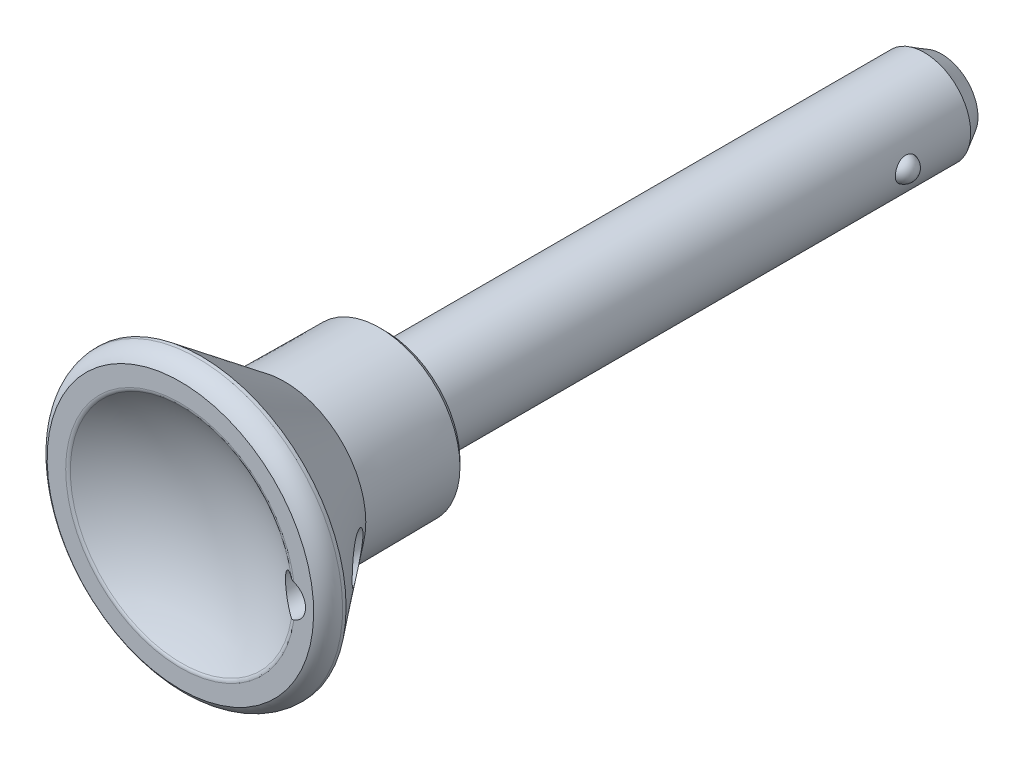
ISO-10303-21;
HEADER;
FILE_DESCRIPTION(('STEP AP214'),'2;1');
FILE_NAME('part.step','',(''),(''),'','','');
FILE_SCHEMA(('AUTOMOTIVE_DESIGN { 1 0 10303 214 1 1 1 1 }'));
ENDSEC;
DATA;
#1=APPLICATION_CONTEXT('core data for automotive mechanical design processes');
#2=APPLICATION_PROTOCOL_DEFINITION('international standard','automotive_design',2000,#1);
#3=PRODUCT_CONTEXT('',#1,'mechanical');
#4=PRODUCT('Part','Part','',(#3));
#5=PRODUCT_RELATED_PRODUCT_CATEGORY('part','',(#4));
#6=PRODUCT_DEFINITION_FORMATION('','',#4);
#7=PRODUCT_DEFINITION_CONTEXT('part definition',#1,'design');
#8=PRODUCT_DEFINITION('design','',#6,#7);
#9=PRODUCT_DEFINITION_SHAPE('','',#8);
#10=(LENGTH_UNIT() NAMED_UNIT(*) SI_UNIT(.MILLI.,.METRE.));
#11=(NAMED_UNIT(*) PLANE_ANGLE_UNIT() SI_UNIT($,.RADIAN.));
#12=(NAMED_UNIT(*) SI_UNIT($,.STERADIAN.) SOLID_ANGLE_UNIT());
#13=UNCERTAINTY_MEASURE_WITH_UNIT(LENGTH_MEASURE(1.E-05),#10,'distance_accuracy_value','');
#14=(GEOMETRIC_REPRESENTATION_CONTEXT(3) GLOBAL_UNCERTAINTY_ASSIGNED_CONTEXT((#13)) GLOBAL_UNIT_ASSIGNED_CONTEXT((#10,
#11,#12)) REPRESENTATION_CONTEXT('',''));
#15=CARTESIAN_POINT('',(0.,0.,0.));
#16=DIRECTION('',(0.,0.,1.));
#17=DIRECTION('',(1.,0.,0.));
#18=AXIS2_PLACEMENT_3D('',#15,#16,#17);
#19=CARTESIAN_POINT('',(0.,0.,0.));
#20=DIRECTION('',(0.,0.,1.));
#21=DIRECTION('',(0.,-1.,0.));
#22=AXIS2_PLACEMENT_3D('',#19,#20,#21);
#23=CYLINDRICAL_SURFACE('',#22,4.);
#24=CARTESIAN_POINT('',(0.,0.,0.));
#25=DIRECTION('',(0.,0.,1.));
#26=DIRECTION('',(0.,-1.,0.));
#27=AXIS2_PLACEMENT_3D('',#24,#25,#26);
#28=CIRCLE('',#27,4.);
#29=CARTESIAN_POINT('',(0.,-4.,0.));
#30=VERTEX_POINT('',#29);
#31=EDGE_CURVE('E17',#30,#30,#28,.T.);
#32=ORIENTED_EDGE('',*,*,#31,.F.);
#33=EDGE_LOOP('',(#32));
#34=FACE_BOUND('',#33,.T.);
#35=CARTESIAN_POINT('',(0.,0.,-46.5));
#36=DIRECTION('',(0.,0.,1.));
#37=DIRECTION('',(1.,0.,0.));
#38=AXIS2_PLACEMENT_3D('',#35,#36,#37);
#39=CIRCLE('',#38,4.);
#40=CARTESIAN_POINT('',(4.,0.,-46.5));
#41=VERTEX_POINT('',#40);
#42=EDGE_CURVE('E111',#41,#41,#39,.T.);
#43=ORIENTED_EDGE('',*,*,#42,.T.);
#44=EDGE_LOOP('',(#43));
#45=FACE_BOUND('',#44,.T.);
#46=CARTESIAN_POINT('',(3.88177455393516,0.965311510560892,-40.7388991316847));
#47=CARTESIAN_POINT('',(3.87947589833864,0.974537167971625,-40.7717537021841));
#48=CARTESIAN_POINT('',(3.87758596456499,0.982015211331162,-40.805105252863));
#49=CARTESIAN_POINT('',(3.87470673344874,0.993322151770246,-40.8719408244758));
#50=CARTESIAN_POINT('',(3.8737042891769,0.997204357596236,-40.9054152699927));
#51=CARTESIAN_POINT('',(3.87228725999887,1.00270077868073,-40.9925132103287));
#52=CARTESIAN_POINT('',(3.87257020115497,1.00161876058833,-41.0463531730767));
#53=CARTESIAN_POINT('',(3.87471439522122,0.993273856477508,-41.1269570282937));
#54=CARTESIAN_POINT('',(3.87573945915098,0.989279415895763,-41.1541316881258));
#55=CARTESIAN_POINT('',(3.87834788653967,0.979001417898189,-41.2080101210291));
#56=CARTESIAN_POINT('',(3.87993110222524,0.972718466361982,-41.2347140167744));
#57=CARTESIAN_POINT('',(3.88177455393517,0.965311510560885,-41.2611008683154));
#58=B_SPLINE_CURVE_WITH_KNOTS('',3,(#46,#47,#48,#49,#50,#51,#52,#53,#54,#55,#56,#57),
.UNSPECIFIED.,.F.,.F.,(4,2,2,2,2,4),(0.,0.102513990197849,0.20348266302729,0.364121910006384,
0.446491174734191,0.528838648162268),.UNSPECIFIED.);
#59=CARTESIAN_POINT('',(3.88177451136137,0.965311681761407,-40.7388997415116));
#60=VERTEX_POINT('',#59);
#61=CARTESIAN_POINT('',(3.88177446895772,0.965311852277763,-41.2610996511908));
#62=VERTEX_POINT('',#61);
#63=EDGE_CURVE('E69',#60,#62,#58,.T.);
#64=ORIENTED_EDGE('',*,*,#63,.T.);
#65=CARTESIAN_POINT('',(3.88177448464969,0.965311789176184,-41.2610998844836));
#66=CARTESIAN_POINT('',(3.88540385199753,0.950638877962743,-41.3155094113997));
#67=CARTESIAN_POINT('',(3.89014046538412,0.931319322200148,-41.3685420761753));
#68=CARTESIAN_POINT('',(3.90112983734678,0.884199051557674,-41.4704413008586));
#69=CARTESIAN_POINT('',(3.90738045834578,0.856410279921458,-41.5193136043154));
#70=CARTESIAN_POINT('',(3.92071189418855,0.79312605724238,-41.6116284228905));
#71=CARTESIAN_POINT('',(3.92779250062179,0.757632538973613,-41.6550722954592));
#72=CARTESIAN_POINT('',(3.94199278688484,0.679892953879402,-41.7354385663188));
#73=CARTESIAN_POINT('',(3.94911247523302,0.637645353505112,-41.7723594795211));
#74=CARTESIAN_POINT('',(3.96270366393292,0.546907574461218,-41.8391103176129));
#75=CARTESIAN_POINT('',(3.96916547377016,0.49834300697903,-41.8688412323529));
#76=CARTESIAN_POINT('',(3.9806028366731,0.396745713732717,-41.9196822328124));
#77=CARTESIAN_POINT('',(3.98557913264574,0.343715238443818,-41.9407966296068));
#78=CARTESIAN_POINT('',(3.99291972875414,0.242471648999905,-41.9713879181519));
#79=CARTESIAN_POINT('',(3.99555479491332,0.194645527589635,-41.9820925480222));
#80=CARTESIAN_POINT('',(3.99909511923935,0.0978826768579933,-41.9963986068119));
#81=CARTESIAN_POINT('',(4.00000061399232,0.0489461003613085,-42.0000010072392));
#82=CARTESIAN_POINT('',(3.99999930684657,-0.0552566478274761,-41.999998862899));
#83=CARTESIAN_POINT('',(3.99884379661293,-0.110525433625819,-41.9954052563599));
#84=CARTESIAN_POINT('',(3.99434700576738,-0.219475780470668,-41.9771816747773));
#85=CARTESIAN_POINT('',(3.9910047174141,-0.273156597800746,-41.9635475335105));
#86=CARTESIAN_POINT('',(3.98250420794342,-0.377347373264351,-41.9277072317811));
#87=CARTESIAN_POINT('',(3.97734807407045,-0.427860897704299,-41.9055109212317));
#88=CARTESIAN_POINT('',(3.96576893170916,-0.524447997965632,-41.8532124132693));
#89=CARTESIAN_POINT('',(3.95934587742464,-0.570521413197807,-41.8231099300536));
#90=CARTESIAN_POINT('',(3.94578204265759,-0.657873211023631,-41.7551953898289));
#91=CARTESIAN_POINT('',(3.93863012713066,-0.699046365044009,-41.7172502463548));
#92=CARTESIAN_POINT('',(3.92448848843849,-0.774509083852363,-41.6350198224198));
#93=CARTESIAN_POINT('',(3.91749874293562,-0.808799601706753,-41.5907354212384));
#94=CARTESIAN_POINT('',(3.90495270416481,-0.867284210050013,-41.5004846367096));
#95=CARTESIAN_POINT('',(3.8993282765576,-0.892041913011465,-41.4548922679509));
#96=CARTESIAN_POINT('',(3.88941506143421,-0.934286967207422,-41.3602904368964));
#97=CARTESIAN_POINT('',(3.88512710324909,-0.951769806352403,-41.3112788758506));
#98=CARTESIAN_POINT('',(3.88177448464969,-0.96531178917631,-41.2610998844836));
#99=B_SPLINE_CURVE_WITH_KNOTS('',3,(#65,#66,#67,#68,#69,#70,#71,#72,#73,#74,#75,#76,#77,#78,#79,
#80,#81,#82,#83,#84,#85,#86,#87,#88,#89,#90,#91,#92,#93,#94,#95,#96,#97,#98),.UNSPECIFIED.,.F.,
.F.,(4,2,2,2,2,2,2,2,2,2,2,2,2,2,2,2,4),(0.,0.169132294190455,0.338027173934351,
0.506879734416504,0.675770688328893,0.846869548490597,1.01788269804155,1.16458276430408,
1.31126276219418,1.47685399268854,1.6425215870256,1.80799916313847,1.97348272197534,
2.14204685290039,2.31058762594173,2.46651284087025,2.62253462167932),.UNSPECIFIED.);
#100=CARTESIAN_POINT('',(3.88177451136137,-0.965311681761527,-41.2611002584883));
#101=VERTEX_POINT('',#100);
#102=EDGE_CURVE('E55',#62,#101,#99,.T.);
#103=ORIENTED_EDGE('',*,*,#102,.T.);
#104=CARTESIAN_POINT('',(3.88177455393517,-0.965311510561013,-41.2611008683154));
#105=CARTESIAN_POINT('',(3.87947589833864,-0.974537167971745,-41.2282462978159));
#106=CARTESIAN_POINT('',(3.87758596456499,-0.982015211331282,-41.1948947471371));
#107=CARTESIAN_POINT('',(3.87470673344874,-0.993322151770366,-41.1280591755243));
#108=CARTESIAN_POINT('',(3.8737042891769,-0.997204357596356,-41.0945847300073));
#109=CARTESIAN_POINT('',(3.87228725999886,-1.00270077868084,-41.0074867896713));
#110=CARTESIAN_POINT('',(3.87257020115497,-1.00161876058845,-40.9536468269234));
#111=CARTESIAN_POINT('',(3.87471439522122,-0.99327385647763,-40.8730429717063));
#112=CARTESIAN_POINT('',(3.87573945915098,-0.989279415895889,-40.8458683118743));
#113=CARTESIAN_POINT('',(3.87834788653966,-0.97900141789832,-40.791989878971));
#114=CARTESIAN_POINT('',(3.87993110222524,-0.972718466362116,-40.7652859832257));
#115=CARTESIAN_POINT('',(3.88177455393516,-0.96531151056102,-40.7388991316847));
#116=B_SPLINE_CURVE_WITH_KNOTS('',3,(#104,#105,#106,#107,#108,#109,#110,#111,#112,#113,#114,
#115),.UNSPECIFIED.,.F.,.F.,(4,2,2,2,2,4),(0.,0.102513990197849,0.203482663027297,
0.364121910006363,0.446491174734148,0.528838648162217),.UNSPECIFIED.);
#117=CARTESIAN_POINT('',(3.88177446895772,-0.965311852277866,-40.7389003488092));
#118=VERTEX_POINT('',#117);
#119=EDGE_CURVE('E62',#101,#118,#116,.T.);
#120=ORIENTED_EDGE('',*,*,#119,.T.);
#121=CARTESIAN_POINT('',(3.88177448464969,-0.965311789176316,-40.7389001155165));
#122=CARTESIAN_POINT('',(3.88540385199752,-0.950638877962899,-40.6844905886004));
#123=CARTESIAN_POINT('',(3.89014046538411,-0.931319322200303,-40.6314579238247));
#124=CARTESIAN_POINT('',(3.90112983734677,-0.884199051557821,-40.5295586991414));
#125=CARTESIAN_POINT('',(3.90738045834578,-0.856410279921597,-40.4806863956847));
#126=CARTESIAN_POINT('',(3.92071189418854,-0.793126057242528,-40.3883715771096));
#127=CARTESIAN_POINT('',(3.92779250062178,-0.757632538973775,-40.3449277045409));
#128=CARTESIAN_POINT('',(3.94199278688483,-0.67989295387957,-40.2645614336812));
#129=CARTESIAN_POINT('',(3.94911247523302,-0.637645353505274,-40.2276405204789));
#130=CARTESIAN_POINT('',(3.96270366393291,-0.546907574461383,-40.1608896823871));
#131=CARTESIAN_POINT('',(3.96916547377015,-0.498343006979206,-40.1311587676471));
#132=CARTESIAN_POINT('',(3.98060283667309,-0.396745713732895,-40.0803177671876));
#133=CARTESIAN_POINT('',(3.98557913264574,-0.343715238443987,-40.0592033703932));
#134=CARTESIAN_POINT('',(3.99291972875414,-0.242471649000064,-40.0286120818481));
#135=CARTESIAN_POINT('',(3.99555479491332,-0.194645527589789,-40.0179074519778));
#136=CARTESIAN_POINT('',(3.99909511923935,-0.0978826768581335,-40.0036013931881));
#137=CARTESIAN_POINT('',(4.00000061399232,-0.048946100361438,-39.9999989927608));
#138=CARTESIAN_POINT('',(3.99999930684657,0.0552566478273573,-40.000001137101));
#139=CARTESIAN_POINT('',(3.99884379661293,0.110525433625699,-40.0045947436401));
#140=CARTESIAN_POINT('',(3.99434700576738,0.219475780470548,-40.0228183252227));
#141=CARTESIAN_POINT('',(3.9910047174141,0.273156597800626,-40.0364524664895));
#142=CARTESIAN_POINT('',(3.98250420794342,0.377347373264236,-40.0722927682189));
#143=CARTESIAN_POINT('',(3.97734807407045,0.427860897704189,-40.0944890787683));
#144=CARTESIAN_POINT('',(3.96576893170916,0.524447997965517,-40.1467875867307));
#145=CARTESIAN_POINT('',(3.95934587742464,0.570521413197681,-40.1768900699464));
#146=CARTESIAN_POINT('',(3.94578204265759,0.657873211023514,-40.2448046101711));
#147=CARTESIAN_POINT('',(3.93863012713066,0.699046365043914,-40.2827497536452));
#148=CARTESIAN_POINT('',(3.92448848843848,0.774509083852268,-40.3649801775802));
#149=CARTESIAN_POINT('',(3.91749874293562,0.808799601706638,-40.4092645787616));
#150=CARTESIAN_POINT('',(3.90495270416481,0.867284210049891,-40.4995153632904));
#151=CARTESIAN_POINT('',(3.8993282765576,0.892041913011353,-40.5451077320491));
#152=CARTESIAN_POINT('',(3.8894150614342,0.934286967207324,-40.6397095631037));
#153=CARTESIAN_POINT('',(3.88512710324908,0.951769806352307,-40.6887211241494));
#154=CARTESIAN_POINT('',(3.88177448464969,0.96531178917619,-40.7389001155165));
#155=B_SPLINE_CURVE_WITH_KNOTS('',3,(#121,#122,#123,#124,#125,#126,#127,#128,#129,#130,#131,
#132,#133,#134,#135,#136,#137,#138,#139,#140,#141,#142,#143,#144,#145,#146,#147,#148,#149,#150,
#151,#152,#153,#154),.UNSPECIFIED.,.F.,.F.,(4,2,2,2,2,2,2,2,2,2,2,2,2,2,2,2,4),(0.,
0.169132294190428,0.338027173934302,0.506879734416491,0.675770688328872,0.846869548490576,
1.01788269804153,1.16458276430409,1.31126276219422,1.47685399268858,1.64252158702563,
1.80799916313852,1.97348272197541,2.14204685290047,2.31058762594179,2.46651284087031,
2.6225346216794),.UNSPECIFIED.);
#156=EDGE_CURVE('E67',#118,#60,#155,.T.);
#157=ORIENTED_EDGE('',*,*,#156,.T.);
#158=EDGE_LOOP('',(#64,#103,#120,#157));
#159=FACE_BOUND('',#158,.T.);
#160=ADVANCED_FACE('F14',(#34,#45,#159),#23,.T.);
#161=CARTESIAN_POINT('',(6.4240762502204,-6.50116727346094,0.));
#162=DIRECTION('',(0.,0.,-1.));
#163=DIRECTION('',(-1.,0.,0.));
#164=AXIS2_PLACEMENT_3D('',#161,#162,#163);
#165=PLANE('',#164);
#166=ORIENTED_EDGE('',*,*,#31,.T.);
#167=EDGE_LOOP('',(#166));
#168=FACE_BOUND('',#167,.T.);
#169=CARTESIAN_POINT('',(0.,0.,0.));
#170=DIRECTION('',(0.,0.,1.));
#171=DIRECTION('',(0.,-1.,0.));
#172=AXIS2_PLACEMENT_3D('',#169,#170,#171);
#173=CIRCLE('',#172,6.4240762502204);
#174=CARTESIAN_POINT('',(0.,-6.4240762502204,0.));
#175=VERTEX_POINT('',#174);
#176=EDGE_CURVE('E186',#175,#175,#173,.T.);
#177=ORIENTED_EDGE('',*,*,#176,.F.);
#178=EDGE_LOOP('',(#177));
#179=FACE_BOUND('',#178,.T.);
#180=ADVANCED_FACE('F205',(#168,#179),#165,.T.);
#181=CARTESIAN_POINT('',(0.,0.,0.));
#182=DIRECTION('',(0.,0.,1.));
#183=DIRECTION('',(0.,-1.,0.));
#184=AXIS2_PLACEMENT_3D('',#181,#182,#183);
#185=CONICAL_SURFACE('',#184,6.4240762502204,0.789761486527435);
#186=CARTESIAN_POINT('',(0.,0.,0.499980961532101));
#187=DIRECTION('',(0.,0.,-1.));
#188=DIRECTION('',(1.,0.,0.));
#189=AXIS2_PLACEMENT_3D('',#186,#187,#188);
#190=CIRCLE('',#189,6.92843951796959);
#191=CARTESIAN_POINT('',(6.92843951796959,0.,0.499980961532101));
#192=VERTEX_POINT('',#191);
#193=EDGE_CURVE('E182',#192,#192,#190,.F.);
#194=ORIENTED_EDGE('',*,*,#193,.F.);
#195=EDGE_LOOP('',(#194));
#196=FACE_BOUND('',#195,.T.);
#197=ORIENTED_EDGE('',*,*,#176,.T.);
#198=EDGE_LOOP('',(#197));
#199=FACE_BOUND('',#198,.T.);
#200=ADVANCED_FACE('F210',(#196,#199),#185,.T.);
#201=CARTESIAN_POINT('',(0.,0.,0.499980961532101));
#202=DIRECTION('',(0.,0.,1.));
#203=DIRECTION('',(0.,-1.,0.));
#204=AXIS2_PLACEMENT_3D('',#201,#202,#203);
#205=CONICAL_SURFACE('',#204,6.92843951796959,0.00872664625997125);
#206=CARTESIAN_POINT('',(0.,0.,8.7));
#207=DIRECTION('',(0.,0.,-1.));
#208=DIRECTION('',(1.,0.,0.));
#209=AXIS2_PLACEMENT_3D('',#206,#207,#208);
#210=CIRCLE('',#209,7.);
#211=CARTESIAN_POINT('',(7.,0.,8.7));
#212=VERTEX_POINT('',#211);
#213=EDGE_CURVE('E178',#212,#212,#210,.F.);
#214=ORIENTED_EDGE('',*,*,#213,.F.);
#215=EDGE_LOOP('',(#214));
#216=FACE_BOUND('',#215,.T.);
#217=ORIENTED_EDGE('',*,*,#193,.T.);
#218=EDGE_LOOP('',(#217));
#219=FACE_BOUND('',#218,.T.);
#220=ADVANCED_FACE('F279',(#216,#219),#205,.T.);
#221=CARTESIAN_POINT('',(0.,0.,16.2));
#222=DIRECTION('',(0.,0.,1.));
#223=DIRECTION('',(0.,-1.,0.));
#224=AXIS2_PLACEMENT_3D('',#221,#222,#223);
#225=CYLINDRICAL_SURFACE('',#224,12.5);
#226=CARTESIAN_POINT('',(0.,0.,15.9));
#227=DIRECTION('',(0.,0.,-1.));
#228=DIRECTION('',(1.,0.,0.));
#229=AXIS2_PLACEMENT_3D('',#226,#227,#228);
#230=CIRCLE('',#229,12.5);
#231=CARTESIAN_POINT('',(12.5,0.,15.9));
#232=VERTEX_POINT('',#231);
#233=EDGE_CURVE('E179',#232,#232,#230,.T.);
#234=ORIENTED_EDGE('',*,*,#233,.F.);
#235=EDGE_LOOP('',(#234));
#236=FACE_BOUND('',#235,.T.);
#237=CARTESIAN_POINT('',(0.,0.,16.2));
#238=DIRECTION('',(0.,0.,1.));
#239=DIRECTION('',(0.,-1.,0.));
#240=AXIS2_PLACEMENT_3D('',#237,#238,#239);
#241=CIRCLE('',#240,12.5);
#242=CARTESIAN_POINT('',(0.,-12.5,16.2));
#243=VERTEX_POINT('',#242);
#244=EDGE_CURVE('E175',#243,#243,#241,.T.);
#245=ORIENTED_EDGE('',*,*,#244,.F.);
#246=EDGE_LOOP('',(#245));
#247=FACE_BOUND('',#246,.T.);
#248=ADVANCED_FACE('F270',(#236,#247),#225,.T.);
#249=CARTESIAN_POINT('',(0.,0.,8.7));
#250=DIRECTION('',(0.,0.,1.));
#251=DIRECTION('',(0.,-1.,0.));
#252=AXIS2_PLACEMENT_3D('',#249,#250,#251);
#253=CONICAL_SURFACE('',#252,7.,0.65233090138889);
#254=CARTESIAN_POINT('',(9.05806451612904,-1.48036050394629,11.5515077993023));
#255=CARTESIAN_POINT('',(8.99141512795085,-1.46946825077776,11.4631001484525));
#256=CARTESIAN_POINT('',(8.92550148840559,-1.45408557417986,11.3746905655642));
#257=CARTESIAN_POINT('',(8.7955636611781,-1.41427171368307,11.1984472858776));
#258=CARTESIAN_POINT('',(8.73154031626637,-1.38983655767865,11.1106138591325));
#259=CARTESIAN_POINT('',(8.60623315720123,-1.33170423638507,10.936758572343));
#260=CARTESIAN_POINT('',(8.54493725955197,-1.29805393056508,10.8507298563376));
#261=CARTESIAN_POINT('',(8.42544336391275,-1.22074353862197,10.6811358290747));
#262=CARTESIAN_POINT('',(8.36724184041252,-1.17709515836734,10.5975677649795));
#263=CARTESIAN_POINT('',(8.26922940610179,-1.09114708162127,10.4552980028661));
#264=CARTESIAN_POINT('',(8.22852162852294,-1.05135683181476,10.3957022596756));
#265=CARTESIAN_POINT('',(8.14989980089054,-0.964725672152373,10.2796936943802));
#266=CARTESIAN_POINT('',(8.11198828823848,-0.917878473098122,10.2232837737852));
#267=CARTESIAN_POINT('',(8.03963417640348,-0.815744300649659,10.1148327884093));
#268=CARTESIAN_POINT('',(8.00522654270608,-0.760383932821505,10.0628364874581));
#269=CARTESIAN_POINT('',(7.94192848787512,-0.640477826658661,9.96655825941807));
#270=CARTESIAN_POINT('',(7.91302454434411,-0.575955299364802,9.92225744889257));
#271=CARTESIAN_POINT('',(7.87251252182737,-0.463057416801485,9.85986137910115));
#272=CARTESIAN_POINT('',(7.85846623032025,-0.417573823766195,9.8381417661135));
#273=CARTESIAN_POINT('',(7.83441768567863,-0.323152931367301,9.80086955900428));
#274=CARTESIAN_POINT('',(7.82440740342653,-0.274222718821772,9.78530472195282));
#275=CARTESIAN_POINT('',(7.81132335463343,-0.187620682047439,9.76493500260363));
#276=CARTESIAN_POINT('',(7.80710048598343,-0.15053785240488,9.7583503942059));
#277=CARTESIAN_POINT('',(7.80143783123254,-0.0756412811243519,9.74951765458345));
#278=CARTESIAN_POINT('',(7.79999798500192,-0.0378275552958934,9.7472694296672));
#279=CARTESIAN_POINT('',(7.8000025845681,0.0485200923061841,9.74727695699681));
#280=CARTESIAN_POINT('',(7.80237736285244,0.0970629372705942,9.75098545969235));
#281=CARTESIAN_POINT('',(7.81164444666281,0.192651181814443,9.76543406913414));
#282=CARTESIAN_POINT('',(7.81854204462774,0.239694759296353,9.77618241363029));
#283=CARTESIAN_POINT('',(7.83829683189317,0.341610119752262,9.80688772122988));
#284=CARTESIAN_POINT('',(7.85215507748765,0.395817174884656,9.82838678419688));
#285=CARTESIAN_POINT('',(7.8845198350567,0.499375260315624,9.87838349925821));
#286=CARTESIAN_POINT('',(7.90303499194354,0.548717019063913,9.9068941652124));
#287=CARTESIAN_POINT('',(7.95423062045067,0.667068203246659,9.98533549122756));
#288=CARTESIAN_POINT('',(7.98924354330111,0.732796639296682,10.0386516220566));
#289=CARTESIAN_POINT('',(8.06472209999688,0.853932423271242,10.1525776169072));
#290=CARTESIAN_POINT('',(8.10520064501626,0.909314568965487,10.2132047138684));
#291=CARTESIAN_POINT('',(8.18383548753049,1.00367842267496,10.3298982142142));
#292=CARTESIAN_POINT('',(8.22147534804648,1.04387385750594,10.3853483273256));
#293=CARTESIAN_POINT('',(8.29898008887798,1.1184153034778,10.4986148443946));
#294=CARTESIAN_POINT('',(8.33884646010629,1.15275733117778,10.556432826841));
#295=CARTESIAN_POINT('',(8.42042546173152,1.21614962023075,10.6737908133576));
#296=CARTESIAN_POINT('',(8.46214099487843,1.24519116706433,10.7333334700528));
#297=CARTESIAN_POINT('',(8.54706483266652,1.29830522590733,10.8535675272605));
#298=CARTESIAN_POINT('',(8.59027353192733,1.32237641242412,10.9142592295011));
#299=CARTESIAN_POINT('',(8.69675324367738,1.37513054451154,11.0626135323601));
#300=CARTESIAN_POINT('',(8.7606819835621,1.40136483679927,11.150681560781));
#301=CARTESIAN_POINT('',(8.89058399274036,1.4446681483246,11.3275915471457));
#302=CARTESIAN_POINT('',(8.95655819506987,1.46173291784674,11.4164338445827));
#303=CARTESIAN_POINT('',(9.09008194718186,1.48679092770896,11.5942301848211));
#304=CARTESIAN_POINT('',(9.15763151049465,1.49478409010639,11.683184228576));
#305=CARTESIAN_POINT('',(9.293788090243,1.50153429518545,11.8605390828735));
#306=CARTESIAN_POINT('',(9.36239469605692,1.50029483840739,11.9489400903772));
#307=CARTESIAN_POINT('',(9.53896432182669,1.48478544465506,12.1740527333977));
#308=CARTESIAN_POINT('',(9.64741582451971,1.46359594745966,12.3100469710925));
#309=CARTESIAN_POINT('',(9.80896256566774,1.41213790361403,12.5095339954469));
#310=CARTESIAN_POINT('',(9.86259038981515,1.39172486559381,12.5752398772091));
#311=CARTESIAN_POINT('',(9.96902195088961,1.34380635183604,12.7046889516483));
#312=CARTESIAN_POINT('',(10.021826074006,1.31630431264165,12.7684330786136));
#313=CARTESIAN_POINT('',(10.1398540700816,1.24522266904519,12.9099256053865));
#314=CARTESIAN_POINT('',(10.2046458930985,1.1993124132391,12.9868895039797));
#315=CARTESIAN_POINT('',(10.3299573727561,1.09357010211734,13.1345591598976));
#316=CARTESIAN_POINT('',(10.3904821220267,1.03375502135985,13.2052724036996));
#317=CARTESIAN_POINT('',(10.4895745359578,0.916081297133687,13.3202576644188));
#318=CARTESIAN_POINT('',(10.5297805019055,0.861692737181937,13.3666468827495));
#319=CARTESIAN_POINT('',(10.6043536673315,0.743973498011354,13.452316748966));
#320=CARTESIAN_POINT('',(10.6387288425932,0.680655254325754,13.4916071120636));
#321=CARTESIAN_POINT('',(10.6925693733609,0.560424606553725,13.5529446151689));
#322=CARTESIAN_POINT('',(10.7136506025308,0.50520820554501,13.5768833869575));
#323=CARTESIAN_POINT('',(10.7495749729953,0.390302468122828,13.6176027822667));
#324=CARTESIAN_POINT('',(10.7644289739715,0.330621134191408,13.6343958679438));
#325=CARTESIAN_POINT('',(10.7836092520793,0.225596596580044,13.656059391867));
#326=CARTESIAN_POINT('',(10.7897268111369,0.180990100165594,13.6629607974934));
#327=CARTESIAN_POINT('',(10.7979243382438,0.0909301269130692,13.6722061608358));
#328=CARTESIAN_POINT('',(10.8000037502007,0.0454765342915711,13.6745494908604));
#329=CARTESIAN_POINT('',(10.799994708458,-0.0641674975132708,13.6745397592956));
#330=CARTESIAN_POINT('',(10.795841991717,-0.12838067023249,13.6698606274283));
#331=CARTESIAN_POINT('',(10.7796239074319,-0.254506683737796,13.6515601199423));
#332=CARTESIAN_POINT('',(10.7675483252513,-0.316416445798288,13.6379272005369));
#333=CARTESIAN_POINT('',(10.7366563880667,-0.435644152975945,13.6029693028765));
#334=CARTESIAN_POINT('',(10.7178919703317,-0.492993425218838,13.5817035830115));
#335=CARTESIAN_POINT('',(10.6748799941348,-0.60264554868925,13.5328118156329));
#336=CARTESIAN_POINT('',(10.6506301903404,-0.654946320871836,13.5051831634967));
#337=CARTESIAN_POINT('',(10.5859735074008,-0.776472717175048,13.431253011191));
#338=CARTESIAN_POINT('',(10.5432056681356,-0.842728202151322,13.3821425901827));
#339=CARTESIAN_POINT('',(10.4516580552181,-0.964099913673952,13.2763616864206));
#340=CARTESIAN_POINT('',(10.4028645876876,-1.01918998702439,13.2196739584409));
#341=CARTESIAN_POINT('',(10.2766029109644,-1.14345503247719,13.0719673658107));
#342=CARTESIAN_POINT('',(10.1967753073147,-1.20635475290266,12.9777102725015));
#343=CARTESIAN_POINT('',(10.0329696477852,-1.31236147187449,12.7820645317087));
#344=CARTESIAN_POINT('',(9.94898466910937,-1.35543413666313,12.6806638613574));
#345=CARTESIAN_POINT('',(9.79718248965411,-1.41705079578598,12.4951419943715));
#346=CARTESIAN_POINT('',(9.72964852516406,-1.43883766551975,12.4118303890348));
#347=CARTESIAN_POINT('',(9.59439459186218,-1.47247845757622,12.2433068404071));
#348=CARTESIAN_POINT('',(9.52667453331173,-1.48432617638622,12.1580937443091));
#349=CARTESIAN_POINT('',(9.39151350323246,-1.49875216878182,11.9862568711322));
#350=CARTESIAN_POINT('',(9.32407407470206,-1.50130123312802,11.8996295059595));
#351=CARTESIAN_POINT('',(9.19020636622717,-1.49747387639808,11.725837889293));
#352=CARTESIAN_POINT('',(9.12377782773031,-1.49109977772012,11.6386737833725));
#353=CARTESIAN_POINT('',(9.05806451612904,-1.48036050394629,11.5515077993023));
#354=B_SPLINE_CURVE_WITH_KNOTS('',3,(#254,#255,#256,#257,#258,#259,#260,#261,#262,#263,#264,
#265,#266,#267,#268,#269,#270,#271,#272,#273,#274,#275,#276,#277,#278,#279,#280,#281,#282,#283,
#284,#285,#286,#287,#288,#289,#290,#291,#292,#293,#294,#295,#296,#297,#298,#299,#300,#301,#302,
#303,#304,#305,#306,#307,#308,#309,#310,#311,#312,#313,#314,#315,#316,#317,#318,#319,#320,#321,
#322,#323,#324,#325,#326,#327,#328,#329,#330,#331,#332,#333,#334,#335,#336,#337,#338,#339,#340,
#341,#342,#343,#344,#345,#346,#347,#348,#349,#350,#351,#352,#353),.UNSPECIFIED.,.T.,.F.,(4,2,2,
2,2,2,2,2,2,2,2,2,2,2,2,2,2,2,2,2,2,2,2,2,2,2,2,2,2,2,2,2,2,2,2,2,2,2,2,2,2,2,2,2,2,2,2,2,2,4),
(0.,0.333658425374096,0.667463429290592,0.999601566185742,1.33135280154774,1.57826788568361,
1.82540433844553,2.07480511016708,2.32358497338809,2.48005639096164,2.63621497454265,
2.74958301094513,2.86294859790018,3.00835870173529,3.15393926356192,3.33275537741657,
3.51190592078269,3.78514778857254,4.05904679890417,4.2931693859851,4.52745067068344,
4.76211373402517,4.9968392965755,5.33221840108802,5.66775280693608,6.0032900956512,
6.33870017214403,6.86226215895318,7.12372139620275,7.38505412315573,7.71589293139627,
8.04632996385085,8.29159071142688,8.53651321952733,8.72709088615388,8.91733480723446,
9.05359735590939,9.18987866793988,9.3821719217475,9.57471358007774,9.7657916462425,
9.95694806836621,10.2340958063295,10.5118854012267,10.9254412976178,11.3397106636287,
11.6675345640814,11.995562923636,12.3246208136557,12.6535930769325),.UNSPECIFIED.);
#355=CARTESIAN_POINT('',(9.05806451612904,-1.48036050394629,11.5515077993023));
#356=VERTEX_POINT('',#355);
#357=EDGE_CURVE('E145',#356,#356,#354,.T.);
#358=ORIENTED_EDGE('',*,*,#357,.F.);
#359=EDGE_LOOP('',(#358));
#360=FACE_BOUND('',#359,.T.);
#361=ORIENTED_EDGE('',*,*,#233,.T.);
#362=EDGE_LOOP('',(#361));
#363=FACE_BOUND('',#362,.T.);
#364=ORIENTED_EDGE('',*,*,#213,.T.);
#365=EDGE_LOOP('',(#364));
#366=FACE_BOUND('',#365,.T.);
#367=ADVANCED_FACE('F168',(#360,#363,#366),#253,.T.);
#368=CARTESIAN_POINT('',(0.,0.,15.9596620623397));
#369=DIRECTION('',(0.,0.,1.));
#370=DIRECTION('',(0.,-1.,0.));
#371=AXIS2_PLACEMENT_3D('',#368,#369,#370);
#372=TOROIDAL_SURFACE('',#371,10.5144930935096,2.);
#373=ORIENTED_EDGE('',*,*,#244,.T.);
#374=EDGE_LOOP('',(#373));
#375=FACE_BOUND('',#374,.T.);
#376=CARTESIAN_POINT('',(0.,0.,17.7));
#377=DIRECTION('',(0.,0.,1.));
#378=DIRECTION('',(0.,-1.,0.));
#379=AXIS2_PLACEMENT_3D('',#376,#377,#378);
#380=CIRCLE('',#379,11.5);
#381=CARTESIAN_POINT('',(0.,-11.5,17.7));
#382=VERTEX_POINT('',#381);
#383=EDGE_CURVE('E190',#382,#382,#380,.T.);
#384=ORIENTED_EDGE('',*,*,#383,.F.);
#385=EDGE_LOOP('',(#384));
#386=FACE_BOUND('',#385,.T.);
#387=ADVANCED_FACE('F160',(#375,#386),#372,.T.);
#388=CARTESIAN_POINT('',(9.3,0.,9.7468824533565));
#389=DIRECTION('',(0.,0.,1.));
#390=DIRECTION('',(0.,-1.,0.));
#391=AXIS2_PLACEMENT_3D('',#388,#389,#390);
#392=CYLINDRICAL_SURFACE('',#391,1.5);
#393=ORIENTED_EDGE('',*,*,#357,.T.);
#394=EDGE_LOOP('',(#393));
#395=FACE_BOUND('',#394,.T.);
#396=CARTESIAN_POINT('',(9.79838709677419,-1.41478277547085,17.7));
#397=CARTESIAN_POINT('',(9.76967463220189,-1.42493393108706,17.7000278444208));
#398=CARTESIAN_POINT('',(9.74057958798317,-1.43416331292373,17.6978154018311));
#399=CARTESIAN_POINT('',(9.68339626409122,-1.45046247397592,17.688811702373));
#400=CARTESIAN_POINT('',(9.65530246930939,-1.45758512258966,17.6821493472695));
#401=CARTESIAN_POINT('',(9.60265119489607,-1.46937623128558,17.6649718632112));
#402=CARTESIAN_POINT('',(9.5780018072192,-1.47420693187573,17.6548534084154));
#403=CARTESIAN_POINT('',(9.52973678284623,-1.48251466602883,17.6305344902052));
#404=CARTESIAN_POINT('',(9.50616459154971,-1.48595330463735,17.6162348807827));
#405=CARTESIAN_POINT('',(9.48387096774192,-1.48868783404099,17.6));
#406=B_SPLINE_CURVE_WITH_KNOTS('',3,(#396,#397,#398,#399,#400,#401,#402,#403,#404,#405),
.UNSPECIFIED.,.F.,.F.,(4,2,2,2,4),(0.,0.0913475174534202,0.180157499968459,0.261045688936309,
0.344033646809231),.UNSPECIFIED.);
#407=CARTESIAN_POINT('',(9.79838709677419,-1.41478277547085,17.7));
#408=VERTEX_POINT('',#407);
#409=CARTESIAN_POINT('',(9.48387096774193,-1.48868783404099,17.6));
#410=VERTEX_POINT('',#409);
#411=EDGE_CURVE('E137',#408,#410,#406,.T.);
#412=ORIENTED_EDGE('',*,*,#411,.F.);
#413=CARTESIAN_POINT('',(9.3,0.,17.7));
#414=DIRECTION('',(0.,0.,1.));
#415=DIRECTION('',(0.,-1.,0.));
#416=AXIS2_PLACEMENT_3D('',#413,#414,#415);
#417=CIRCLE('',#416,1.5);
#418=CARTESIAN_POINT('',(9.79838709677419,1.41478277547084,17.7));
#419=VERTEX_POINT('',#418);
#420=EDGE_CURVE('E30',#419,#408,#417,.F.);
#421=ORIENTED_EDGE('',*,*,#420,.F.);
#422=CARTESIAN_POINT('',(9.79838709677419,1.41478277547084,17.7));
#423=CARTESIAN_POINT('',(9.76967463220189,1.42493393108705,17.7000278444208));
#424=CARTESIAN_POINT('',(9.74057958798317,1.43416331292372,17.6978154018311));
#425=CARTESIAN_POINT('',(9.68339626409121,1.45046247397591,17.688811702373));
#426=CARTESIAN_POINT('',(9.65530246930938,1.45758512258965,17.6821493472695));
#427=CARTESIAN_POINT('',(9.60265119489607,1.46937623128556,17.6649718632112));
#428=CARTESIAN_POINT('',(9.57800180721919,1.47420693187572,17.6548534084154));
#429=CARTESIAN_POINT('',(9.52973678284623,1.48251466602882,17.6305344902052));
#430=CARTESIAN_POINT('',(9.50616459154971,1.48595330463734,17.6162348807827));
#431=CARTESIAN_POINT('',(9.48387096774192,1.48868783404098,17.6));
#432=B_SPLINE_CURVE_WITH_KNOTS('',3,(#422,#423,#424,#425,#426,#427,#428,#429,#430,#431),
.UNSPECIFIED.,.F.,.F.,(4,2,2,2,4),(0.,0.0913475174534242,0.180157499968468,0.261045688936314,
0.344033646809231),.UNSPECIFIED.);
#433=CARTESIAN_POINT('',(9.48387096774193,1.48868783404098,17.6));
#434=VERTEX_POINT('',#433);
#435=EDGE_CURVE('E129',#419,#434,#432,.T.);
#436=ORIENTED_EDGE('',*,*,#435,.T.);
#437=CARTESIAN_POINT('',(9.48387096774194,-1.48868783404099,17.6));
#438=CARTESIAN_POINT('',(9.38181447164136,-1.5012604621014,17.5258231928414));
#439=CARTESIAN_POINT('',(9.27847034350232,-1.50339409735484,17.4514075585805));
#440=CARTESIAN_POINT('',(9.07150168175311,-1.48616897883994,17.3036113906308));
#441=CARTESIAN_POINT('',(8.96788247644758,-1.46662385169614,17.230245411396));
#442=CARTESIAN_POINT('',(8.76570217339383,-1.40554015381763,17.0882393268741));
#443=CARTESIAN_POINT('',(8.66709675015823,-1.36425592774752,17.0195547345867));
#444=CARTESIAN_POINT('',(8.47807170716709,-1.25938003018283,16.8888158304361));
#445=CARTESIAN_POINT('',(8.38761877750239,-1.19588484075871,16.8267343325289));
#446=CARTESIAN_POINT('',(8.24568836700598,-1.0697955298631,16.7298945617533));
#447=CARTESIAN_POINT('',(8.19079097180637,-1.01295594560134,16.692612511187));
#448=CARTESIAN_POINT('',(8.08925811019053,-0.889102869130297,16.6238983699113));
#449=CARTESIAN_POINT('',(8.04262373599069,-0.822088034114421,16.5924670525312));
#450=CARTESIAN_POINT('',(7.95961243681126,-0.678453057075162,16.5366671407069));
#451=CARTESIAN_POINT('',(7.9233211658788,-0.601759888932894,16.5123574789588));
#452=CARTESIAN_POINT('',(7.86387797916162,-0.441385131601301,16.4726071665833));
#453=CARTESIAN_POINT('',(7.84069382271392,-0.357721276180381,16.4571447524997));
#454=CARTESIAN_POINT('',(7.81665644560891,-0.227526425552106,16.4411240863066));
#455=CARTESIAN_POINT('',(7.81042627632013,-0.182354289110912,16.4369745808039));
#456=CARTESIAN_POINT('',(7.80209606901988,-0.091465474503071,16.4314273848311));
#457=CARTESIAN_POINT('',(7.79999581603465,-0.0457488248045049,16.4300295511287));
#458=CARTESIAN_POINT('',(7.8000067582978,0.0738974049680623,16.4300365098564));
#459=CARTESIAN_POINT('',(7.80550430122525,0.147878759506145,16.4336949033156));
#460=CARTESIAN_POINT('',(7.82172596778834,0.257047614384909,16.4445026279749));
#461=CARTESIAN_POINT('',(7.82847272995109,0.293170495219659,16.4489987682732));
#462=CARTESIAN_POINT('',(7.84452794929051,0.364609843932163,16.4597055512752));
#463=CARTESIAN_POINT('',(7.85383787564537,0.399925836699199,16.4659171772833));
#464=CARTESIAN_POINT('',(7.88533418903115,0.503926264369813,16.4869492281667));
#465=CARTESIAN_POINT('',(7.91114789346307,0.571060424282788,16.5042071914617));
#466=CARTESIAN_POINT('',(7.97122958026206,0.699580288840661,16.5444764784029));
#467=CARTESIAN_POINT('',(8.00550445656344,0.760961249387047,16.5674924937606));
#468=CARTESIAN_POINT('',(8.06330229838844,0.849663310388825,16.6064232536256));
#469=CARTESIAN_POINT('',(8.08431449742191,0.879441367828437,16.6205962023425));
#470=CARTESIAN_POINT('',(8.12808579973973,0.936974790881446,16.6501700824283));
#471=CARTESIAN_POINT('',(8.15084283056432,0.964732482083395,16.6655695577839));
#472=CARTESIAN_POINT('',(8.22150377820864,1.04495101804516,16.7134720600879));
#473=CARTESIAN_POINT('',(8.27178709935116,1.09434151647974,16.7476721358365));
#474=CARTESIAN_POINT('',(8.38550726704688,1.19170689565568,16.8253434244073));
#475=CARTESIAN_POINT('',(8.44976642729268,1.2382209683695,16.8694253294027));
#476=CARTESIAN_POINT('',(8.58287694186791,1.31978473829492,16.961227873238));
#477=CARTESIAN_POINT('',(8.65173257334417,1.3548235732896,17.0089519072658));
#478=CARTESIAN_POINT('',(8.76337185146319,1.40144242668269,17.0867690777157));
#479=CARTESIAN_POINT('',(8.80522580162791,1.41674274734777,17.1160369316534));
#480=CARTESIAN_POINT('',(8.88962205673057,1.44344948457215,17.1752539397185));
#481=CARTESIAN_POINT('',(8.93216367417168,1.45485956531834,17.2052024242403));
#482=CARTESIAN_POINT('',(9.06048356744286,1.4833442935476,17.2958544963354));
#483=CARTESIAN_POINT('',(9.14699642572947,1.4946896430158,17.3573922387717));
#484=CARTESIAN_POINT('',(9.31725275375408,1.50223877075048,17.4793658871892));
#485=CARTESIAN_POINT('',(9.40099551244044,1.49891929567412,17.5397732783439));
#486=CARTESIAN_POINT('',(9.48387096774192,1.4886878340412,17.6));
#487=B_SPLINE_CURVE_WITH_KNOTS('',3,(#437,#438,#439,#440,#441,#442,#443,#444,#445,#446,#447,
#448,#449,#450,#451,#452,#453,#454,#455,#456,#457,#458,#459,#460,#461,#462,#463,#464,#465,#466,
#467,#468,#469,#470,#471,#472,#473,#474,#475,#476,#477,#478,#479,#480,#481,#482,#483,#484,#485,
#486),.UNSPECIFIED.,.F.,.F.,(4,2,2,2,2,2,2,2,2,2,2,2,2,2,2,2,2,2,2,2,2,2,2,2,4),(0.,
0.380173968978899,0.763641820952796,1.14271969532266,1.52017093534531,1.7812816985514,
2.0424269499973,2.30567583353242,2.5682743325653,2.70539664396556,2.84251181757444,
3.06399194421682,3.17494513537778,3.28596205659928,3.50680011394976,3.72781870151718,
3.84503226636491,3.96210870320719,4.19632161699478,4.4675973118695,4.73912905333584,
4.89893578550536,5.05859157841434,5.37775215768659,5.6866146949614),.UNSPECIFIED.);
#488=EDGE_CURVE('E144',#410,#434,#487,.T.);
#489=ORIENTED_EDGE('',*,*,#488,.F.);
#490=EDGE_LOOP('',(#412,#421,#436,#489));
#491=FACE_BOUND('',#490,.T.);
#492=ADVANCED_FACE('F155',(#395,#491),#392,.F.);
#493=CARTESIAN_POINT('',(0.,0.,30.4));
#494=DIRECTION('',(0.,-1.,0.));
#495=DIRECTION('',(0.,0.,1.));
#496=AXIS2_PLACEMENT_3D('',#493,#494,#495);
#497=SPHERICAL_SURFACE('',#496,16.);
#498=ORIENTED_EDGE('',*,*,#488,.T.);
#499=CARTESIAN_POINT('',(0.,0.,17.6));
#500=DIRECTION('',(0.,0.,1.));
#501=DIRECTION('',(0.,-1.,0.));
#502=AXIS2_PLACEMENT_3D('',#499,#500,#501);
#503=CIRCLE('',#502,9.6);
#504=EDGE_CURVE('E23',#410,#434,#503,.F.);
#505=ORIENTED_EDGE('',*,*,#504,.F.);
#506=EDGE_LOOP('',(#498,#505));
#507=FACE_BOUND('',#506,.T.);
#508=ADVANCED_FACE('F159',(#507),#497,.F.);
#509=CARTESIAN_POINT('',(-11.73,-11.4999999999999,17.7));
#510=CARTESIAN_POINT('',(-11.5,-11.4999999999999,17.7));
#511=CARTESIAN_POINT('',(11.5,-11.4999999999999,17.7));
#512=B_SPLINE_CURVE_WITH_KNOTS('',1,(#509,#510,#511),.UNSPECIFIED.,.F.,.F.,(2,1,2),(-0.01,0.,
1.),.UNSPECIFIED.);
#513=DIRECTION('',(0.,1.,0.));
#514=VECTOR('',#513,1.);
#515=SURFACE_OF_LINEAR_EXTRUSION('',#512,#514);
#516=ORIENTED_EDGE('',*,*,#420,.T.);
#517=CARTESIAN_POINT('',(0.,0.,17.7));
#518=DIRECTION('',(0.,0.,1.));
#519=DIRECTION('',(0.,-1.,0.));
#520=AXIS2_PLACEMENT_3D('',#517,#518,#519);
#521=CIRCLE('',#520,9.9);
#522=EDGE_CURVE('E9',#419,#408,#521,.T.);
#523=ORIENTED_EDGE('',*,*,#522,.F.);
#524=EDGE_LOOP('',(#516,#523));
#525=FACE_BOUND('',#524,.T.);
#526=ORIENTED_EDGE('',*,*,#383,.T.);
#527=EDGE_LOOP('',(#526));
#528=FACE_BOUND('',#527,.T.);
#529=ADVANCED_FACE('F124',(#525,#528),#515,.T.);
#530=CARTESIAN_POINT('',(0.,0.,17.2));
#531=DIRECTION('',(0.,0.,1.));
#532=DIRECTION('',(0.,-1.,0.));
#533=AXIS2_PLACEMENT_3D('',#530,#531,#532);
#534=TOROIDAL_SURFACE('',#533,9.89999999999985,0.50000000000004);
#535=ORIENTED_EDGE('',*,*,#435,.F.);
#536=ORIENTED_EDGE('',*,*,#522,.T.);
#537=ORIENTED_EDGE('',*,*,#411,.T.);
#538=ORIENTED_EDGE('',*,*,#504,.T.);
#539=EDGE_LOOP('',(#535,#536,#537,#538));
#540=FACE_BOUND('',#539,.T.);
#541=ADVANCED_FACE('F120',(#540),#534,.T.);
#542=CARTESIAN_POINT('',(3.13397459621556,-3.17158441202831,-48.));
#543=DIRECTION('',(0.,0.,-1.));
#544=DIRECTION('',(-1.,0.,0.));
#545=AXIS2_PLACEMENT_3D('',#542,#543,#544);
#546=PLANE('',#545);
#547=CARTESIAN_POINT('',(0.,0.,-48.));
#548=DIRECTION('',(0.,0.,1.));
#549=DIRECTION('',(0.,-1.,0.));
#550=AXIS2_PLACEMENT_3D('',#547,#548,#549);
#551=CIRCLE('',#550,3.13397459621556);
#552=CARTESIAN_POINT('',(0.,-3.13397459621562,-48.));
#553=VERTEX_POINT('',#552);
#554=EDGE_CURVE('E71',#553,#553,#551,.T.);
#555=ORIENTED_EDGE('',*,*,#554,.F.);
#556=EDGE_LOOP('',(#555));
#557=FACE_BOUND('',#556,.T.);
#558=ADVANCED_FACE('F97',(#557),#546,.T.);
#559=CARTESIAN_POINT('',(3.88177446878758,0.,-41.));
#560=DIRECTION('',(1.,0.,0.));
#561=DIRECTION('',(0.,-1.,0.));
#562=AXIS2_PLACEMENT_3D('',#559,#560,#561);
#563=CYLINDRICAL_SURFACE('',#562,1.);
#564=ORIENTED_EDGE('',*,*,#156,.F.);
#565=CARTESIAN_POINT('',(3.88177446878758,0.,-41.));
#566=DIRECTION('',(1.,0.,0.));
#567=DIRECTION('',(0.,-1.,0.));
#568=AXIS2_PLACEMENT_3D('',#565,#566,#567);
#569=CIRCLE('',#568,1.);
#570=EDGE_CURVE('E59',#118,#60,#569,.F.);
#571=ORIENTED_EDGE('',*,*,#570,.T.);
#572=EDGE_LOOP('',(#564,#571));
#573=FACE_BOUND('',#572,.T.);
#574=ADVANCED_FACE('F96',(#573),#563,.F.);
#575=CARTESIAN_POINT('',(3.88177446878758,0.,-41.));
#576=DIRECTION('',(1.,0.,0.));
#577=DIRECTION('',(0.,-1.,0.));
#578=AXIS2_PLACEMENT_3D('',#575,#576,#577);
#579=CYLINDRICAL_SURFACE('',#578,1.);
#580=CARTESIAN_POINT('',(3.88177446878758,0.,-41.));
#581=DIRECTION('',(1.,0.,0.));
#582=DIRECTION('',(0.,-1.,0.));
#583=AXIS2_PLACEMENT_3D('',#580,#581,#582);
#584=CIRCLE('',#583,1.);
#585=EDGE_CURVE('E51',#101,#62,#584,.T.);
#586=ORIENTED_EDGE('',*,*,#585,.F.);
#587=ORIENTED_EDGE('',*,*,#102,.F.);
#588=EDGE_LOOP('',(#586,#587));
#589=FACE_BOUND('',#588,.T.);
#590=ADVANCED_FACE('F53',(#589),#579,.F.);
#591=CARTESIAN_POINT('',(3.74,0.,-41.));
#592=DIRECTION('',(0.,-1.,0.));
#593=DIRECTION('',(0.,0.,-1.));
#594=AXIS2_PLACEMENT_3D('',#591,#592,#593);
#595=SPHERICAL_SURFACE('',#594,1.01);
#596=ORIENTED_EDGE('',*,*,#63,.F.);
#597=ORIENTED_EDGE('',*,*,#570,.F.);
#598=ORIENTED_EDGE('',*,*,#119,.F.);
#599=ORIENTED_EDGE('',*,*,#585,.T.);
#600=EDGE_LOOP('',(#596,#597,#598,#599));
#601=FACE_BOUND('',#600,.T.);
#602=ADVANCED_FACE('F63',(#601),#595,.T.);
#603=CARTESIAN_POINT('',(0.,0.,-48.));
#604=DIRECTION('',(0.,0.,1.));
#605=DIRECTION('',(0.,-1.,0.));
#606=AXIS2_PLACEMENT_3D('',#603,#604,#605);
#607=CONICAL_SURFACE('',#606,3.13397459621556,0.523598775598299);
#608=ORIENTED_EDGE('',*,*,#42,.F.);
#609=EDGE_LOOP('',(#608));
#610=FACE_BOUND('',#609,.T.);
#611=ORIENTED_EDGE('',*,*,#554,.T.);
#612=EDGE_LOOP('',(#611));
#613=FACE_BOUND('',#612,.T.);
#614=ADVANCED_FACE('F102',(#610,#613),#607,.T.);
#615=CLOSED_SHELL('',(#160,#180,#200,#220,#248,#367,#387,#492,#508,#529,#541,#558,#574,#590,
#602,#614));
#616=MANIFOLD_SOLID_BREP('B1',#615);
#617=ADVANCED_BREP_SHAPE_REPRESENTATION('',(#18,#616),#14);
#618=SHAPE_DEFINITION_REPRESENTATION(#9,#617);
ENDSEC;
END-ISO-10303-21;
